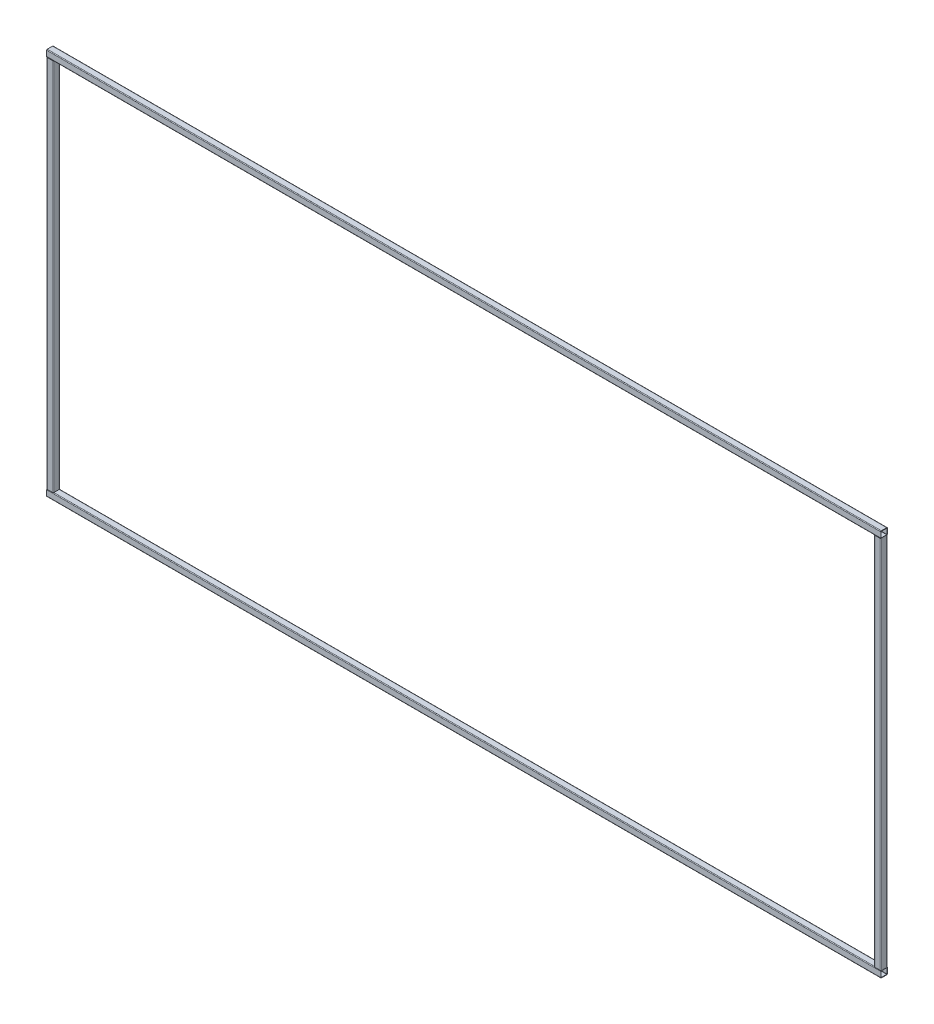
from build123d import *

# Parameters (mm, degrees)
STRUKTURBAUTEIL1_DEPTH      = 5020
STRUKTURBAUTEIL1_DEPTH_BACK = 20
STRUKTURBAUTEIL1_2_DEPTH    = 5040
STRUKTURBAUTEIL1_3_DEPTH    = 2302
STRUKTURBAUTEIL1_4_DEPTH    = 2302


with BuildPart() as part:
    # Skizze1 → Strukturbauteil1 (new, two sides: drawn at the far end of the back side and taken through both)
    with BuildSketch(Plane(origin=(-2500, 1150, 0), x_dir=(0, 1, 0), z_dir=(1, 0, 0)).offset(-STRUKTURBAUTEIL1_DEPTH_BACK)):
        with BuildLine():
            Line((16, -20), (-16, -20))
            ThreePointArc((-16, -20), (-18.828427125, -18.828427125), (-20, -16))
            Line((-20, -16), (-20, 16))
            ThreePointArc((-20, 16), (-18.828427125, 18.828427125), (-16, 20))
            Line((-16, 20), (16, 20))
            ThreePointArc((16, 20), (18.828427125, 18.828427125), (20, 16))
            Line((20, 16), (20, -16))
            ThreePointArc((20, -16), (18.828427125, -18.828427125), (16, -20))
        make_face()
        with BuildLine():
            Line((17, -16), (17, 16))
            ThreePointArc((17, 16), (16.707106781, 16.707106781), (16, 17))
            Line((16, 17), (-16, 17))
            ThreePointArc((-16, 17), (-16.707106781, 16.707106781), (-17, 16))
            Line((-17, 16), (-17, -16))
            ThreePointArc((-17, -16), (-16.707106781, -16.707106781), (-16, -17))
            Line((-16, -17), (16, -17))
            ThreePointArc((16, -17), (16.707106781, -16.707106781), (17, -16))
        make_face(mode=Mode.SUBTRACT)
    extrude(amount=STRUKTURBAUTEIL1_DEPTH + STRUKTURBAUTEIL1_DEPTH_BACK)


with BuildPart() as body_2:
    # Skizze1 on segment 2 (on carried to segment 2) → Strukturbauteil1 2 (new body)
    with BuildSketch(Plane(origin=(-2520, -1150, 0), x_dir=(0, 1, 0), z_dir=(1, 0, 0))):
        with BuildLine():
            Line((16, -20), (-16, -20))
            ThreePointArc((-16, -20), (-18.828427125, -18.828427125), (-20, -16))
            Line((-20, -16), (-20, 16))
            ThreePointArc((-20, 16), (-18.828427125, 18.828427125), (-16, 20))
            Line((-16, 20), (16, 20))
            ThreePointArc((16, 20), (18.828427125, 18.828427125), (20, 16))
            Line((20, 16), (20, -16))
            ThreePointArc((20, -16), (18.828427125, -18.828427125), (16, -20))
        make_face()
        with BuildLine():
            Line((17, -16), (17, 16))
            ThreePointArc((17, 16), (16.707106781, 16.707106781), (16, 17))
            Line((16, 17), (-16, 17))
            ThreePointArc((-16, 17), (-16.707106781, 16.707106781), (-17, 16))
            Line((-17, 16), (-17, -16))
            ThreePointArc((-17, -16), (-16.707106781, -16.707106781), (-16, -17))
            Line((-16, -17), (16, -17))
            ThreePointArc((16, -17), (16.707106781, -16.707106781), (17, -16))
        make_face(mode=Mode.SUBTRACT)
    extrude(amount=STRUKTURBAUTEIL1_2_DEPTH)


with BuildPart() as body_3:
    # Skizze1 on segment 3 (on carried to segment 3) → Strukturbauteil1 3 (new body)
    with BuildSketch(Plane(origin=(-2500, -1151, 0), x_dir=(-1, 0, 0), z_dir=(0, 1, 0))):
        with BuildLine():
            Line((16, -20), (-16, -20))
            ThreePointArc((-16, -20), (-18.828427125, -18.828427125), (-20, -16))
            Line((-20, -16), (-20, 16))
            ThreePointArc((-20, 16), (-18.828427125, 18.828427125), (-16, 20))
            Line((-16, 20), (16, 20))
            ThreePointArc((16, 20), (18.828427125, 18.828427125), (20, 16))
            Line((20, 16), (20, -16))
            ThreePointArc((20, -16), (18.828427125, -18.828427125), (16, -20))
        make_face()
        with BuildLine():
            Line((17, -16), (17, 16))
            ThreePointArc((17, 16), (16.707106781, 16.707106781), (16, 17))
            Line((16, 17), (-16, 17))
            ThreePointArc((-16, 17), (-16.707106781, 16.707106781), (-17, 16))
            Line((-17, 16), (-17, -16))
            ThreePointArc((-17, -16), (-16.707106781, -16.707106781), (-16, -17))
            Line((-16, -17), (16, -17))
            ThreePointArc((16, -17), (16.707106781, -16.707106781), (17, -16))
        make_face(mode=Mode.SUBTRACT)
    extrude(amount=STRUKTURBAUTEIL1_3_DEPTH)

    # Strukturbauteil1 3 end butt 1
    split(bisect_by=Plane(origin=(-2500, -1130, 0), x_dir=(-1, 0, 0), z_dir=(0, 1, 0)), keep=Keep.TOP)

    # Strukturbauteil1 3 end butt 2
    split(bisect_by=Plane(origin=(-2500, 1130, 0), x_dir=(1, 0, 0), z_dir=(0, -1, 0)), keep=Keep.TOP)


with BuildPart() as body_4:
    # Skizze1 on segment 4 (on carried to segment 4) → Strukturbauteil1 4 (new body)
    with BuildSketch(Plane(origin=(2500, -1151, 0), x_dir=(-1, 0, 0), z_dir=(0, 1, 0))):
        with BuildLine():
            Line((16, -20), (-16, -20))
            ThreePointArc((-16, -20), (-18.828427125, -18.828427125), (-20, -16))
            Line((-20, -16), (-20, 16))
            ThreePointArc((-20, 16), (-18.828427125, 18.828427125), (-16, 20))
            Line((-16, 20), (16, 20))
            ThreePointArc((16, 20), (18.828427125, 18.828427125), (20, 16))
            Line((20, 16), (20, -16))
            ThreePointArc((20, -16), (18.828427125, -18.828427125), (16, -20))
        make_face()
        with BuildLine():
            Line((17, -16), (17, 16))
            ThreePointArc((17, 16), (16.707106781, 16.707106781), (16, 17))
            Line((16, 17), (-16, 17))
            ThreePointArc((-16, 17), (-16.707106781, 16.707106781), (-17, 16))
            Line((-17, 16), (-17, -16))
            ThreePointArc((-17, -16), (-16.707106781, -16.707106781), (-16, -17))
            Line((-16, -17), (16, -17))
            ThreePointArc((16, -17), (16.707106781, -16.707106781), (17, -16))
        make_face(mode=Mode.SUBTRACT)
    extrude(amount=STRUKTURBAUTEIL1_4_DEPTH)

    # Strukturbauteil1 4 end butt 1
    split(bisect_by=Plane(origin=(2500, -1130, 0), x_dir=(-1, 0, 0), z_dir=(0, 1, 0)), keep=Keep.TOP)

    # Strukturbauteil1 4 end butt 2
    split(bisect_by=Plane(origin=(2500, 1130, 0), x_dir=(1, 0, 0), z_dir=(0, -1, 0)), keep=Keep.TOP)


solid = Compound([part.part, body_2.part, body_3.part, body_4.part])
